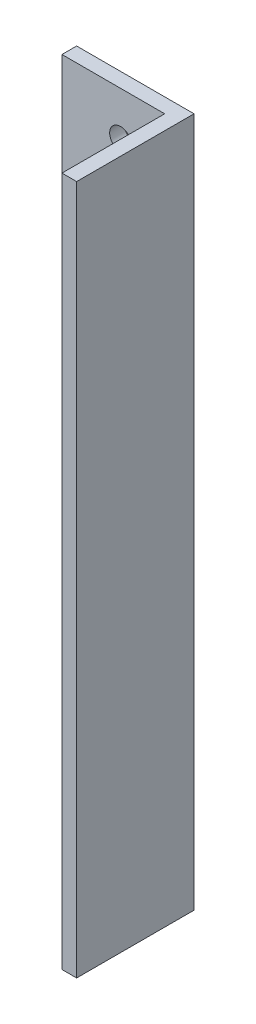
from build123d import *

# Parameters (mm, degrees)
BOSS_EXTRUDE1_DEPTH = 74.6125
SKETCH2_R           = 2.38125
CUT_EXTRUDE1_DEPTH  = 80.8340476
LPATTERN1_COUNT     = 4
LPATTERN1_PITCH     = 25.4


with BuildPart() as part:
    # Sketch1 → Boss-Extrude1 (new, symmetric)
    with BuildSketch(Plane(origin=(0, 0, 0), x_dir=(1, 0, 0), z_dir=(0, 1, 0))):
        Polygon((-9.525, 9.525), (9.525, 9.525), (9.525, -9.525), (9.525, -12.7), (12.7, -12.7), (12.7, 12.7), (-12.7, 12.7), (-12.7, 9.525), align=None)
    extrude(amount=BOSS_EXTRUDE1_DEPTH, both=True)

    # Sketch2 → Cut-Extrude1 (cut, through all)
    with BuildSketch(Plane(origin=(0, 0, -12.7), x_dir=(-1, 0, 0), z_dir=(0, 0, -1))):
        with Locations((0, 65.0875)):
            Circle(SKETCH2_R)
    cut_extrude1 = extrude(amount=-CUT_EXTRUDE1_DEPTH, mode=Mode.SUBTRACT)

    # LPattern1: Cut-Extrude1 ×4
    with Locations(*[(0, -i * LPATTERN1_PITCH, 0) for i in range(1, LPATTERN1_COUNT)]):
        add(cut_extrude1, mode=Mode.SUBTRACT)


solid = part.part
